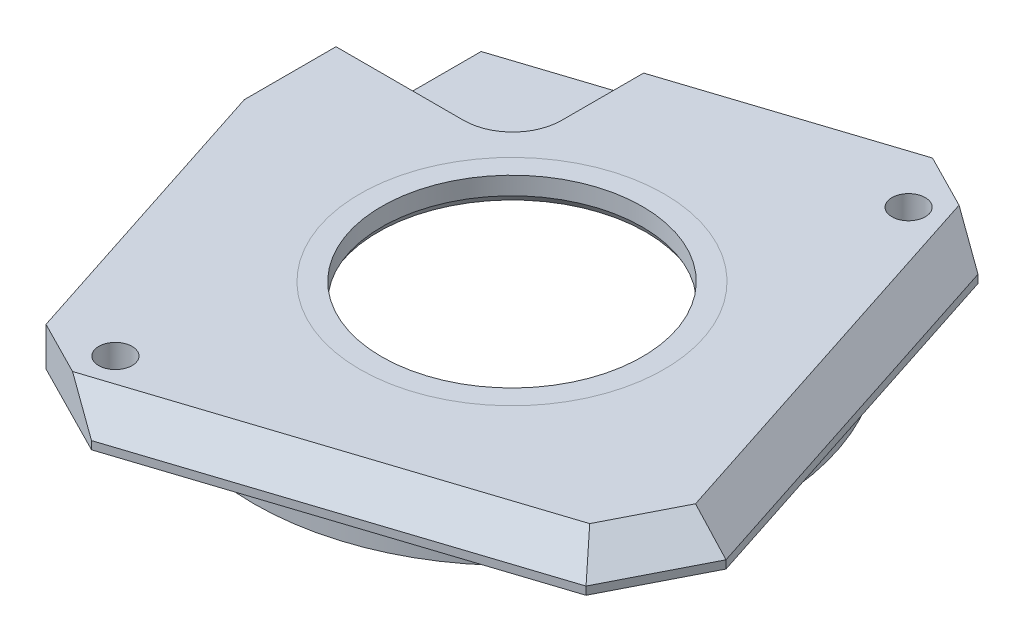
ISO-10303-21;
HEADER;
FILE_DESCRIPTION(('STEP AP214'),'2;1');
FILE_NAME('part.step','',(''),(''),'','','');
FILE_SCHEMA(('AUTOMOTIVE_DESIGN { 1 0 10303 214 1 1 1 1 }'));
ENDSEC;
DATA;
#1=APPLICATION_CONTEXT('core data for automotive mechanical design processes');
#2=APPLICATION_PROTOCOL_DEFINITION('international standard','automotive_design',2000,#1);
#3=PRODUCT_CONTEXT('',#1,'mechanical');
#4=PRODUCT('Part','Part','',(#3));
#5=PRODUCT_RELATED_PRODUCT_CATEGORY('part','',(#4));
#6=PRODUCT_DEFINITION_FORMATION('','',#4);
#7=PRODUCT_DEFINITION_CONTEXT('part definition',#1,'design');
#8=PRODUCT_DEFINITION('design','',#6,#7);
#9=PRODUCT_DEFINITION_SHAPE('','',#8);
#10=(LENGTH_UNIT() NAMED_UNIT(*) SI_UNIT(.MILLI.,.METRE.));
#11=(NAMED_UNIT(*) PLANE_ANGLE_UNIT() SI_UNIT($,.RADIAN.));
#12=(NAMED_UNIT(*) SI_UNIT($,.STERADIAN.) SOLID_ANGLE_UNIT());
#13=UNCERTAINTY_MEASURE_WITH_UNIT(LENGTH_MEASURE(1.E-05),#10,'distance_accuracy_value','');
#14=(GEOMETRIC_REPRESENTATION_CONTEXT(3) GLOBAL_UNCERTAINTY_ASSIGNED_CONTEXT((#13)) GLOBAL_UNIT_ASSIGNED_CONTEXT((#10,
#11,#12)) REPRESENTATION_CONTEXT('',''));
#15=CARTESIAN_POINT('',(0.,0.,0.));
#16=DIRECTION('',(0.,0.,1.));
#17=DIRECTION('',(1.,0.,0.));
#18=AXIS2_PLACEMENT_3D('',#15,#16,#17);
#19=CARTESIAN_POINT('',(0.,4.00558,0.));
#20=DIRECTION('',(0.,1.,0.));
#21=DIRECTION('',(0.,0.,1.));
#22=AXIS2_PLACEMENT_3D('',#19,#20,#21);
#23=PLANE('',#22);
#24=DIRECTION('',(1.,0.,0.));
#25=VECTOR('',#24,1.);
#26=CARTESIAN_POINT('',(-11.887,4.00558,-11.9534025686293));
#27=LINE('',#26,#25);
#28=CARTESIAN_POINT('',(-30.175,4.00558,-11.9534025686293));
#29=VERTEX_POINT('',#28);
#30=CARTESIAN_POINT('',(-16.967,4.00558,-11.9534025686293));
#31=VERTEX_POINT('',#30);
#32=EDGE_CURVE('E214',#29,#31,#27,.T.);
#33=ORIENTED_EDGE('',*,*,#32,.F.);
#34=DIRECTION('',(0.,0.,1.));
#35=VECTOR('',#34,1.);
#36=CARTESIAN_POINT('',(-30.175,4.00558,-2.45336121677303));
#37=LINE('',#36,#35);
#38=CARTESIAN_POINT('',(-30.175,4.00558,-2.45336121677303));
#39=VERTEX_POINT('',#38);
#40=EDGE_CURVE('E240',#29,#39,#37,.T.);
#41=ORIENTED_EDGE('',*,*,#40,.T.);
#42=DIRECTION('',(0.309017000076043,0.,0.951056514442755));
#43=VECTOR('',#42,1.);
#44=CARTESIAN_POINT('',(-30.175,4.00558,-2.45336121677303));
#45=LINE('',#44,#43);
#46=CARTESIAN_POINT('',(-20.2932935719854,4.00558,27.9594033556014));
#47=VERTEX_POINT('',#46);
#48=EDGE_CURVE('E243',#39,#47,#45,.T.);
#49=ORIENTED_EDGE('',*,*,#48,.T.);
#50=DIRECTION('',(-0.891006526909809,0.,-0.453990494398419));
#51=VECTOR('',#50,1.);
#52=CARTESIAN_POINT('',(-15.4924134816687,4.00558,30.4055739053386));
#53=LINE('',#52,#51);
#54=CARTESIAN_POINT('',(-14.6922667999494,4.00558,30.8132689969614));
#55=VERTEX_POINT('',#54);
#56=EDGE_CURVE('E298',#47,#55,#53,.F.);
#57=ORIENTED_EDGE('',*,*,#56,.T.);
#58=DIRECTION('',(0.951056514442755,0.,-0.309017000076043));
#59=VECTOR('',#58,1.);
#60=CARTESIAN_POINT('',(7.65280600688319,4.00558,23.5529145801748));
#61=LINE('',#60,#59);
#62=CARTESIAN_POINT('',(25.7275132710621,4.00558,17.6800860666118));
#63=VERTEX_POINT('',#62);
#64=EDGE_CURVE('E329',#55,#63,#61,.T.);
#65=ORIENTED_EDGE('',*,*,#64,.T.);
#66=DIRECTION('',(0.453990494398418,0.,-0.891006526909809));
#67=VECTOR('',#66,1.);
#68=CARTESIAN_POINT('',(27.5766281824,4.00558,14.0509936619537));
#69=LINE('',#68,#67);
#70=CARTESIAN_POINT('',(29.4257430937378,4.00558,10.4219012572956));
#71=VERTEX_POINT('',#70);
#72=EDGE_CURVE('E332',#63,#71,#69,.T.);
#73=ORIENTED_EDGE('',*,*,#72,.T.);
#74=DIRECTION('',(-0.309017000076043,0.,-0.951056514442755));
#75=VECTOR('',#74,1.);
#76=CARTESIAN_POINT('',(23.5529145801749,4.00558,-7.65280600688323));
#77=LINE('',#76,#75);
#78=CARTESIAN_POINT('',(16.2925601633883,4.00558,-29.9978788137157));
#79=VERTEX_POINT('',#78);
#80=EDGE_CURVE('E335',#71,#79,#77,.T.);
#81=ORIENTED_EDGE('',*,*,#80,.T.);
#82=DIRECTION('',(0.891006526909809,0.,0.453990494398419));
#83=VECTOR('',#82,1.);
#84=CARTESIAN_POINT('',(15.4924134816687,4.00558,-30.4055739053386));
#85=LINE('',#84,#83);
#86=CARTESIAN_POINT('',(10.6915333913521,4.00558,-32.8517444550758));
#87=VERTEX_POINT('',#86);
#88=EDGE_CURVE('E302',#79,#87,#85,.F.);
#89=ORIENTED_EDGE('',*,*,#88,.T.);
#90=DIRECTION('',(-0.951056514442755,0.,0.309017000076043));
#91=VECTOR('',#90,1.);
#92=CARTESIAN_POINT('',(-10.2361999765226,4.00558,-26.0519115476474));
#93=LINE('',#92,#91);
#94=CARTESIAN_POINT('',(-11.887,4.00558,-25.5155340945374));
#95=VERTEX_POINT('',#94);
#96=EDGE_CURVE('E247',#87,#95,#93,.T.);
#97=ORIENTED_EDGE('',*,*,#96,.T.);
#98=DIRECTION('',(0.,0.,-1.));
#99=VECTOR('',#98,1.);
#100=CARTESIAN_POINT('',(-11.887,4.00558,-11.9534025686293));
#101=LINE('',#100,#99);
#102=CARTESIAN_POINT('',(-11.887,4.00558,-17.0334025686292));
#103=VERTEX_POINT('',#102);
#104=EDGE_CURVE('E208',#103,#95,#101,.T.);
#105=ORIENTED_EDGE('',*,*,#104,.F.);
#106=CARTESIAN_POINT('',(-16.967,4.00558,-17.0334025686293));
#107=DIRECTION('',(0.,1.,0.));
#108=DIRECTION('',(0.,0.,1.));
#109=AXIS2_PLACEMENT_3D('',#106,#107,#108);
#110=CIRCLE('',#109,5.08);
#111=EDGE_CURVE('E74',#103,#31,#110,.F.);
#112=ORIENTED_EDGE('',*,*,#111,.T.);
#113=EDGE_LOOP('',(#33,#41,#49,#57,#65,#73,#81,#89,#97,#105,#112));
#114=FACE_BOUND('',#113,.T.);
#115=CARTESIAN_POINT('',(13.8616330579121,4.00558,-27.204932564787));
#116=DIRECTION('',(0.,1.,0.));
#117=DIRECTION('',(0.,0.,1.));
#118=AXIS2_PLACEMENT_3D('',#115,#116,#117);
#119=CIRCLE('',#118,1.7272);
#120=CARTESIAN_POINT('',(13.8616330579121,4.00558,-25.477732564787));
#121=VERTEX_POINT('',#120);
#122=EDGE_CURVE('E276',#121,#121,#119,.T.);
#123=ORIENTED_EDGE('',*,*,#122,.F.);
#124=EDGE_LOOP('',(#123));
#125=FACE_BOUND('',#124,.T.);
#126=CARTESIAN_POINT('',(-13.86163312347,4.00558,27.2050416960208));
#127=DIRECTION('',(0.,1.,0.));
#128=DIRECTION('',(0.,0.,1.));
#129=AXIS2_PLACEMENT_3D('',#126,#127,#128);
#130=CIRCLE('',#129,1.7272);
#131=CARTESIAN_POINT('',(-13.86163312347,4.00558,28.9322416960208));
#132=VERTEX_POINT('',#131);
#133=EDGE_CURVE('E268',#132,#132,#130,.T.);
#134=ORIENTED_EDGE('',*,*,#133,.F.);
#135=EDGE_LOOP('',(#134));
#136=FACE_BOUND('',#135,.T.);
#137=CARTESIAN_POINT('',(0.,4.00558,0.));
#138=DIRECTION('',(0.,1.,0.));
#139=DIRECTION('',(0.,0.,1.));
#140=AXIS2_PLACEMENT_3D('',#137,#138,#139);
#141=CIRCLE('',#140,15.748);
#142=CARTESIAN_POINT('',(0.,4.00558,15.748));
#143=VERTEX_POINT('',#142);
#144=EDGE_CURVE('E354',#143,#143,#141,.F.);
#145=ORIENTED_EDGE('',*,*,#144,.T.);
#146=EDGE_LOOP('',(#145));
#147=FACE_BOUND('',#146,.T.);
#148=ADVANCED_FACE('F46',(#114,#125,#136,#147),#23,.T.);
#149=CARTESIAN_POINT('',(0.,0.,0.));
#150=DIRECTION('',(0.,1.,0.));
#151=DIRECTION('',(0.,0.,1.));
#152=AXIS2_PLACEMENT_3D('',#149,#150,#151);
#153=PLANE('',#152);
#154=CARTESIAN_POINT('',(0.,0.,0.));
#155=DIRECTION('',(0.,1.,0.));
#156=DIRECTION('',(0.,0.,1.));
#157=AXIS2_PLACEMENT_3D('',#154,#155,#156);
#158=CIRCLE('',#157,26.745999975);
#159=CARTESIAN_POINT('',(0.,0.,26.745999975));
#160=VERTEX_POINT('',#159);
#161=EDGE_CURVE('E287',#160,#160,#158,.F.);
#162=ORIENTED_EDGE('',*,*,#161,.F.);
#163=EDGE_LOOP('',(#162));
#164=FACE_BOUND('',#163,.T.);
#165=CARTESIAN_POINT('',(13.8616330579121,0.,-27.204932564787));
#166=DIRECTION('',(0.,1.,0.));
#167=DIRECTION('',(0.,0.,1.));
#168=AXIS2_PLACEMENT_3D('',#165,#166,#167);
#169=CIRCLE('',#168,1.7272);
#170=CARTESIAN_POINT('',(13.8616330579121,0.,-25.477732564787));
#171=VERTEX_POINT('',#170);
#172=EDGE_CURVE('E272',#171,#171,#169,.T.);
#173=ORIENTED_EDGE('',*,*,#172,.T.);
#174=EDGE_LOOP('',(#173));
#175=FACE_BOUND('',#174,.T.);
#176=CARTESIAN_POINT('',(-13.86163312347,0.,27.2050416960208));
#177=DIRECTION('',(0.,1.,0.));
#178=DIRECTION('',(0.,0.,1.));
#179=AXIS2_PLACEMENT_3D('',#176,#177,#178);
#180=CIRCLE('',#179,1.7272);
#181=CARTESIAN_POINT('',(-13.86163312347,0.,28.9322416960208));
#182=VERTEX_POINT('',#181);
#183=EDGE_CURVE('E267',#182,#182,#180,.T.);
#184=ORIENTED_EDGE('',*,*,#183,.T.);
#185=EDGE_LOOP('',(#184));
#186=FACE_BOUND('',#185,.T.);
#187=DIRECTION('',(-1.,0.,0.));
#188=VECTOR('',#187,1.);
#189=CARTESIAN_POINT('',(-30.175,0.,-11.9534025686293));
#190=LINE('',#189,#188);
#191=CARTESIAN_POINT('',(-24.587,0.,-11.9534025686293));
#192=VERTEX_POINT('',#191);
#193=CARTESIAN_POINT('',(-30.175,0.,-11.9534025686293));
#194=VERTEX_POINT('',#193);
#195=EDGE_CURVE('E525',#192,#194,#190,.T.);
#196=ORIENTED_EDGE('',*,*,#195,.F.);
#197=DIRECTION('',(0.,0.,1.));
#198=VECTOR('',#197,1.);
#199=CARTESIAN_POINT('',(-24.587,0.,-11.9534025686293));
#200=LINE('',#199,#198);
#201=CARTESIAN_POINT('',(-24.587,0.,-21.3890538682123));
#202=VERTEX_POINT('',#201);
#203=EDGE_CURVE('E190',#202,#192,#200,.T.);
#204=ORIENTED_EDGE('',*,*,#203,.F.);
#205=DIRECTION('',(0.951056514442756,0.,-0.309017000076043));
#206=VECTOR('',#205,1.);
#207=CARTESIAN_POINT('',(-10.2361999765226,0.,-26.0519115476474));
#208=LINE('',#207,#206);
#209=CARTESIAN_POINT('',(10.6915333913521,0.,-32.8517444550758));
#210=VERTEX_POINT('',#209);
#211=EDGE_CURVE('E237',#202,#210,#208,.T.);
#212=ORIENTED_EDGE('',*,*,#211,.T.);
#213=DIRECTION('',(-0.891006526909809,0.,-0.453990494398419));
#214=VECTOR('',#213,1.);
#215=CARTESIAN_POINT('',(20.2932935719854,0.,-27.9594033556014));
#216=LINE('',#215,#214);
#217=CARTESIAN_POINT('',(20.2932935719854,0.,-27.9594033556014));
#218=VERTEX_POINT('',#217);
#219=EDGE_CURVE('E315',#210,#218,#216,.F.);
#220=ORIENTED_EDGE('',*,*,#219,.T.);
#221=DIRECTION('',(0.309017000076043,0.,0.951056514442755));
#222=VECTOR('',#221,1.);
#223=CARTESIAN_POINT('',(17.938584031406,0.,-35.2064539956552));
#224=LINE('',#223,#222);
#225=CARTESIAN_POINT('',(32.8517444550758,0.,10.691533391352));
#226=VERTEX_POINT('',#225);
#227=EDGE_CURVE('E233',#218,#226,#224,.T.);
#228=ORIENTED_EDGE('',*,*,#227,.T.);
#229=DIRECTION('',(0.453990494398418,0.,-0.891006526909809));
#230=VECTOR('',#229,1.);
#231=CARTESIAN_POINT('',(27.9594033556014,0.,20.2932935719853));
#232=LINE('',#231,#230);
#233=CARTESIAN_POINT('',(27.9594033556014,0.,20.2932935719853));
#234=VERTEX_POINT('',#233);
#235=EDGE_CURVE('E312',#226,#234,#232,.F.);
#236=ORIENTED_EDGE('',*,*,#235,.T.);
#237=DIRECTION('',(-0.951056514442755,0.,0.309017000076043));
#238=VECTOR('',#237,1.);
#239=CARTESIAN_POINT('',(35.2064539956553,0.,17.9385840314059));
#240=LINE('',#239,#238);
#241=CARTESIAN_POINT('',(-10.6915333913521,0.,32.8517444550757));
#242=VERTEX_POINT('',#241);
#243=EDGE_CURVE('E228',#234,#242,#240,.T.);
#244=ORIENTED_EDGE('',*,*,#243,.T.);
#245=DIRECTION('',(0.891006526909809,0.,0.453990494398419));
#246=VECTOR('',#245,1.);
#247=CARTESIAN_POINT('',(-20.2932935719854,0.,27.9594033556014));
#248=LINE('',#247,#246);
#249=CARTESIAN_POINT('',(-20.2932935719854,0.,27.9594033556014));
#250=VERTEX_POINT('',#249);
#251=EDGE_CURVE('E309',#242,#250,#248,.F.);
#252=ORIENTED_EDGE('',*,*,#251,.T.);
#253=DIRECTION('',(-0.309017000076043,0.,-0.951056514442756));
#254=VECTOR('',#253,1.);
#255=CARTESIAN_POINT('',(-30.175,0.,-2.45336121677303));
#256=LINE('',#255,#254);
#257=CARTESIAN_POINT('',(-30.175,0.,-2.45336121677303));
#258=VERTEX_POINT('',#257);
#259=EDGE_CURVE('E225',#250,#258,#256,.T.);
#260=ORIENTED_EDGE('',*,*,#259,.T.);
#261=DIRECTION('',(0.,0.,-1.));
#262=VECTOR('',#261,1.);
#263=CARTESIAN_POINT('',(-30.175,0.,-2.45336121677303));
#264=LINE('',#263,#262);
#265=EDGE_CURVE('E255',#258,#194,#264,.T.);
#266=ORIENTED_EDGE('',*,*,#265,.T.);
#267=EDGE_LOOP('',(#196,#204,#212,#220,#228,#236,#244,#252,#260,#266));
#268=FACE_BOUND('',#267,.T.);
#269=ADVANCED_FACE('F405',(#164,#175,#186,#268),#153,.F.);
#270=ORIENTED_EDGE('',*,*,#144,.F.);
#271=EDGE_LOOP('',(#270));
#272=FACE_BOUND('',#271,.T.);
#273=CARTESIAN_POINT('',(0.,4.00558,0.));
#274=DIRECTION('',(0.,1.,0.));
#275=DIRECTION('',(0.,0.,1.));
#276=AXIS2_PLACEMENT_3D('',#273,#274,#275);
#277=CIRCLE('',#276,13.49375);
#278=CARTESIAN_POINT('',(0.,4.00558,13.49375));
#279=VERTEX_POINT('',#278);
#280=EDGE_CURVE('E280',#279,#279,#277,.T.);
#281=ORIENTED_EDGE('',*,*,#280,.F.);
#282=EDGE_LOOP('',(#281));
#283=FACE_BOUND('',#282,.T.);
#284=ADVANCED_FACE('F407',(#272,#283),#23,.T.);
#285=CARTESIAN_POINT('',(0.,4.00558,0.));
#286=DIRECTION('',(0.,-1.,0.));
#287=DIRECTION('',(0.,0.,-1.));
#288=AXIS2_PLACEMENT_3D('',#285,#286,#287);
#289=CYLINDRICAL_SURFACE('',#288,13.49375);
#290=CARTESIAN_POINT('',(0.,2.15899999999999,0.));
#291=DIRECTION('',(0.,-1.,0.));
#292=DIRECTION('',(0.,0.,-1.));
#293=AXIS2_PLACEMENT_3D('',#290,#291,#292);
#294=CIRCLE('',#293,13.49375);
#295=CARTESIAN_POINT('',(0.,2.15899999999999,-13.49375));
#296=VERTEX_POINT('',#295);
#297=EDGE_CURVE('E55',#296,#296,#294,.T.);
#298=ORIENTED_EDGE('',*,*,#297,.T.);
#299=EDGE_LOOP('',(#298));
#300=FACE_BOUND('',#299,.T.);
#301=ORIENTED_EDGE('',*,*,#280,.T.);
#302=EDGE_LOOP('',(#301));
#303=FACE_BOUND('',#302,.T.);
#304=ADVANCED_FACE('F393',(#300,#303),#289,.F.);
#305=CARTESIAN_POINT('',(13.8616330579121,4.00558,-27.204932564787));
#306=DIRECTION('',(0.,-1.,0.));
#307=DIRECTION('',(0.,0.,-1.));
#308=AXIS2_PLACEMENT_3D('',#305,#306,#307);
#309=CYLINDRICAL_SURFACE('',#308,1.7272);
#310=ORIENTED_EDGE('',*,*,#122,.T.);
#311=EDGE_LOOP('',(#310));
#312=FACE_BOUND('',#311,.T.);
#313=ORIENTED_EDGE('',*,*,#172,.F.);
#314=EDGE_LOOP('',(#313));
#315=FACE_BOUND('',#314,.T.);
#316=ADVANCED_FACE('F420',(#312,#315),#309,.F.);
#317=CARTESIAN_POINT('',(-13.86163312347,4.00558,27.2050416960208));
#318=DIRECTION('',(0.,-1.,0.));
#319=DIRECTION('',(0.,0.,-1.));
#320=AXIS2_PLACEMENT_3D('',#317,#318,#319);
#321=CYLINDRICAL_SURFACE('',#320,1.7272);
#322=ORIENTED_EDGE('',*,*,#133,.T.);
#323=EDGE_LOOP('',(#322));
#324=FACE_BOUND('',#323,.T.);
#325=ORIENTED_EDGE('',*,*,#183,.F.);
#326=EDGE_LOOP('',(#325));
#327=FACE_BOUND('',#326,.T.);
#328=ADVANCED_FACE('F428',(#324,#327),#321,.F.);
#329=CARTESIAN_POINT('',(0.,1.524,0.));
#330=DIRECTION('',(0.,-1.,0.));
#331=DIRECTION('',(0.,0.,-1.));
#332=AXIS2_PLACEMENT_3D('',#329,#330,#331);
#333=CYLINDRICAL_SURFACE('',#332,21.59);
#334=CARTESIAN_POINT('',(0.,-1.016,0.));
#335=DIRECTION('',(0.,-1.,0.));
#336=DIRECTION('',(0.,0.,-1.));
#337=AXIS2_PLACEMENT_3D('',#334,#335,#336);
#338=CIRCLE('',#337,21.59);
#339=CARTESIAN_POINT('',(0.,-1.016,-21.59));
#340=VERTEX_POINT('',#339);
#341=EDGE_CURVE('E368',#340,#340,#338,.F.);
#342=CARTESIAN_POINT('',(0.,-2.54,0.));
#343=DIRECTION('',(0.,-1.,0.));
#344=DIRECTION('',(0.,0.,-1.));
#345=AXIS2_PLACEMENT_3D('',#342,#343,#344);
#346=CIRCLE('',#345,21.59);
#347=CARTESIAN_POINT('',(0.,-2.54,-21.59));
#348=VERTEX_POINT('',#347);
#349=EDGE_CURVE('E259',#348,#348,#346,.T.);
#350=CARTESIAN_POINT('',(0.,-1.016,-21.59));
#351=CARTESIAN_POINT('',(0.,-1.031875,-21.59));
#352=CARTESIAN_POINT('',(0.,-1.04775,-21.59));
#353=CARTESIAN_POINT('',(0.,-1.0795,-21.59));
#354=CARTESIAN_POINT('',(0.,-1.095375,-21.59));
#355=CARTESIAN_POINT('',(0.,-1.127125,-21.59));
#356=CARTESIAN_POINT('',(0.,-1.143,-21.59));
#357=CARTESIAN_POINT('',(0.,-1.17475,-21.59));
#358=CARTESIAN_POINT('',(0.,-1.190625,-21.59));
#359=CARTESIAN_POINT('',(0.,-1.222375,-21.59));
#360=CARTESIAN_POINT('',(0.,-1.23825,-21.59));
#361=CARTESIAN_POINT('',(0.,-1.27,-21.59));
#362=CARTESIAN_POINT('',(0.,-1.285875,-21.59));
#363=CARTESIAN_POINT('',(0.,-1.317625,-21.59));
#364=CARTESIAN_POINT('',(0.,-1.3335,-21.59));
#365=CARTESIAN_POINT('',(0.,-1.36525,-21.59));
#366=CARTESIAN_POINT('',(0.,-1.381125,-21.59));
#367=CARTESIAN_POINT('',(0.,-1.412875,-21.59));
#368=CARTESIAN_POINT('',(0.,-1.42875,-21.59));
#369=CARTESIAN_POINT('',(0.,-1.4605,-21.59));
#370=CARTESIAN_POINT('',(0.,-1.476375,-21.59));
#371=CARTESIAN_POINT('',(0.,-1.508125,-21.59));
#372=CARTESIAN_POINT('',(0.,-1.524,-21.59));
#373=CARTESIAN_POINT('',(0.,-1.55575,-21.59));
#374=CARTESIAN_POINT('',(0.,-1.571625,-21.59));
#375=CARTESIAN_POINT('',(0.,-1.603375,-21.59));
#376=CARTESIAN_POINT('',(0.,-1.61925,-21.59));
#377=CARTESIAN_POINT('',(0.,-1.651,-21.59));
#378=CARTESIAN_POINT('',(0.,-1.666875,-21.59));
#379=CARTESIAN_POINT('',(0.,-1.698625,-21.59));
#380=CARTESIAN_POINT('',(0.,-1.7145,-21.59));
#381=CARTESIAN_POINT('',(0.,-1.74625,-21.59));
#382=CARTESIAN_POINT('',(0.,-1.762125,-21.59));
#383=CARTESIAN_POINT('',(0.,-1.793875,-21.59));
#384=CARTESIAN_POINT('',(0.,-1.80975,-21.59));
#385=CARTESIAN_POINT('',(0.,-1.8415,-21.59));
#386=CARTESIAN_POINT('',(0.,-1.857375,-21.59));
#387=CARTESIAN_POINT('',(0.,-1.889125,-21.59));
#388=CARTESIAN_POINT('',(0.,-1.905,-21.59));
#389=CARTESIAN_POINT('',(0.,-1.93675,-21.59));
#390=CARTESIAN_POINT('',(0.,-1.952625,-21.59));
#391=CARTESIAN_POINT('',(0.,-1.984375,-21.59));
#392=CARTESIAN_POINT('',(0.,-2.00025,-21.59));
#393=CARTESIAN_POINT('',(0.,-2.032,-21.59));
#394=CARTESIAN_POINT('',(0.,-2.047875,-21.59));
#395=CARTESIAN_POINT('',(0.,-2.079625,-21.59));
#396=CARTESIAN_POINT('',(0.,-2.0955,-21.59));
#397=CARTESIAN_POINT('',(0.,-2.12725,-21.59));
#398=CARTESIAN_POINT('',(0.,-2.143125,-21.59));
#399=CARTESIAN_POINT('',(0.,-2.174875,-21.59));
#400=CARTESIAN_POINT('',(0.,-2.19075,-21.59));
#401=CARTESIAN_POINT('',(0.,-2.2225,-21.59));
#402=CARTESIAN_POINT('',(0.,-2.238375,-21.59));
#403=CARTESIAN_POINT('',(0.,-2.270125,-21.59));
#404=CARTESIAN_POINT('',(0.,-2.286,-21.59));
#405=CARTESIAN_POINT('',(0.,-2.31775,-21.59));
#406=CARTESIAN_POINT('',(0.,-2.333625,-21.59));
#407=CARTESIAN_POINT('',(0.,-2.365375,-21.59));
#408=CARTESIAN_POINT('',(0.,-2.38125,-21.59));
#409=CARTESIAN_POINT('',(0.,-2.413,-21.59));
#410=CARTESIAN_POINT('',(0.,-2.428875,-21.59));
#411=CARTESIAN_POINT('',(0.,-2.460625,-21.59));
#412=CARTESIAN_POINT('',(0.,-2.4765,-21.59));
#413=CARTESIAN_POINT('',(0.,-2.50825,-21.59));
#414=CARTESIAN_POINT('',(0.,-2.524125,-21.59));
#415=CARTESIAN_POINT('',(0.,-2.54,-21.59));
#416=B_SPLINE_CURVE_WITH_KNOTS('',3,(#350,#351,#352,#353,#354,#355,#356,#357,#358,#359,#360,
#361,#362,#363,#364,#365,#366,#367,#368,#369,#370,#371,#372,#373,#374,#375,#376,#377,#378,#379,
#380,#381,#382,#383,#384,#385,#386,#387,#388,#389,#390,#391,#392,#393,#394,#395,#396,#397,#398,
#399,#400,#401,#402,#403,#404,#405,#406,#407,#408,#409,#410,#411,#412,#413,#414,#415),
.UNSPECIFIED.,.F.,.F.,(4,2,2,2,2,2,2,2,2,2,2,2,2,2,2,2,2,2,2,2,2,2,2,2,2,2,2,2,2,2,2,2,4),(0.,
0.0476249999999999,0.0952499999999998,0.142875,0.1905,0.238125,0.28575,0.333375,0.381,0.428625,
0.47625,0.523875,0.5715,0.619125,0.666750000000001,0.714375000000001,0.762000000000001,0.809625,
0.85725,0.904875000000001,0.9525,1.000125,1.04775,1.095375,1.143,1.190625,1.23825,1.285875,
1.3335,1.381125,1.42875,1.476375,1.524),.UNSPECIFIED.);
#417=EDGE_CURVE('BSEAM434',#340,#348,#416,.T.);
#418=ORIENTED_EDGE('',*,*,#341,.T.);
#419=ORIENTED_EDGE('',*,*,#349,.T.);
#420=ORIENTED_EDGE('',*,*,#417,.T.);
#421=ORIENTED_EDGE('',*,*,#417,.F.);
#422=EDGE_LOOP('',(#418,#420,#419,#421));
#423=FACE_BOUND('',#422,.T.);
#424=ADVANCED_FACE('F434',(#423),#333,.F.);
#425=CARTESIAN_POINT('',(0.,1.524,0.));
#426=DIRECTION('',(0.,-1.,0.));
#427=DIRECTION('',(0.,0.,-1.));
#428=AXIS2_PLACEMENT_3D('',#425,#426,#427);
#429=PLANE('',#428);
#430=CARTESIAN_POINT('',(0.,1.524,0.));
#431=DIRECTION('',(0.,-1.,0.));
#432=DIRECTION('',(0.,0.,-1.));
#433=AXIS2_PLACEMENT_3D('',#430,#431,#432);
#434=CIRCLE('',#433,13.8603674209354);
#435=CARTESIAN_POINT('',(0.,1.524,-13.8603674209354));
#436=VERTEX_POINT('',#435);
#437=EDGE_CURVE('E11',#436,#436,#434,.F.);
#438=ORIENTED_EDGE('',*,*,#437,.T.);
#439=EDGE_LOOP('',(#438));
#440=FACE_BOUND('',#439,.T.);
#441=CARTESIAN_POINT('',(0.,1.524,0.));
#442=DIRECTION('',(0.,-1.,0.));
#443=DIRECTION('',(0.,0.,-1.));
#444=AXIS2_PLACEMENT_3D('',#441,#442,#443);
#445=CIRCLE('',#444,19.05);
#446=CARTESIAN_POINT('',(0.,1.524,-19.05));
#447=VERTEX_POINT('',#446);
#448=EDGE_CURVE('E364',#447,#447,#445,.T.);
#449=ORIENTED_EDGE('',*,*,#448,.T.);
#450=EDGE_LOOP('',(#449));
#451=FACE_BOUND('',#450,.T.);
#452=ADVANCED_FACE('F438',(#440,#451),#429,.T.);
#453=CARTESIAN_POINT('',(0.,-2.54,0.));
#454=DIRECTION('',(0.,-1.,0.));
#455=DIRECTION('',(0.,0.,-1.));
#456=AXIS2_PLACEMENT_3D('',#453,#454,#455);
#457=PLANE('',#456);
#458=CARTESIAN_POINT('',(0.,-2.54,0.));
#459=DIRECTION('',(0.,-1.,0.));
#460=DIRECTION('',(0.,0.,-1.));
#461=AXIS2_PLACEMENT_3D('',#458,#459,#460);
#462=CIRCLE('',#461,26.745999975);
#463=CARTESIAN_POINT('',(0.,-2.54,-26.745999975));
#464=VERTEX_POINT('',#463);
#465=EDGE_CURVE('E263',#464,#464,#462,.T.);
#466=ORIENTED_EDGE('',*,*,#465,.T.);
#467=EDGE_LOOP('',(#466));
#468=FACE_BOUND('',#467,.T.);
#469=ORIENTED_EDGE('',*,*,#349,.F.);
#470=EDGE_LOOP('',(#469));
#471=FACE_BOUND('',#470,.T.);
#472=ADVANCED_FACE('F442',(#468,#471),#457,.T.);
#473=CARTESIAN_POINT('',(0.,-2.54,0.));
#474=DIRECTION('',(0.,1.,0.));
#475=DIRECTION('',(0.,0.,1.));
#476=AXIS2_PLACEMENT_3D('',#473,#474,#475);
#477=CYLINDRICAL_SURFACE('',#476,26.745999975);
#478=ORIENTED_EDGE('',*,*,#465,.F.);
#479=EDGE_LOOP('',(#478));
#480=FACE_BOUND('',#479,.T.);
#481=ORIENTED_EDGE('',*,*,#161,.T.);
#482=EDGE_LOOP('',(#481));
#483=FACE_BOUND('',#482,.T.);
#484=ADVANCED_FACE('F444',(#480,#483),#477,.T.);
#485=CARTESIAN_POINT('',(-10.2361999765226,-2.541,-26.0519115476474));
#486=DIRECTION('',(-0.309017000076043,0.,-0.951056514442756));
#487=DIRECTION('',(-0.951056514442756,0.,0.309017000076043));
#488=AXIS2_PLACEMENT_3D('',#485,#486,#487);
#489=PLANE('',#488);
#490=DIRECTION('',(0.,-1.,0.));
#491=VECTOR('',#490,1.);
#492=CARTESIAN_POINT('',(-24.587,-2.541,-21.3890538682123));
#493=LINE('',#492,#491);
#494=CARTESIAN_POINT('',(-24.587,1.651,-21.3890538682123));
#495=VERTEX_POINT('',#494);
#496=EDGE_CURVE('E217',#495,#202,#493,.T.);
#497=ORIENTED_EDGE('',*,*,#496,.F.);
#498=DIRECTION('',(-0.951056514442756,0.,0.309017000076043));
#499=VECTOR('',#498,1.);
#500=CARTESIAN_POINT('',(-10.2361999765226,1.651,-26.0519115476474));
#501=LINE('',#500,#499);
#502=CARTESIAN_POINT('',(-11.887,1.651,-25.5155340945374));
#503=VERTEX_POINT('',#502);
#504=EDGE_CURVE('E199',#503,#495,#501,.T.);
#505=ORIENTED_EDGE('',*,*,#504,.F.);
#506=DIRECTION('',(0.,-1.,0.));
#507=VECTOR('',#506,1.);
#508=CARTESIAN_POINT('',(-11.887,-2.541,-25.5155340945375));
#509=LINE('',#508,#507);
#510=EDGE_CURVE('E375',#95,#503,#509,.T.);
#511=ORIENTED_EDGE('',*,*,#510,.F.);
#512=ORIENTED_EDGE('',*,*,#96,.F.);
#513=DIRECTION('',(0.,-1.,0.));
#514=VECTOR('',#513,1.);
#515=CARTESIAN_POINT('',(10.6915333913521,-2.541,-32.8517444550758));
#516=LINE('',#515,#514);
#517=EDGE_CURVE('E305',#87,#210,#516,.T.);
#518=ORIENTED_EDGE('',*,*,#517,.T.);
#519=ORIENTED_EDGE('',*,*,#211,.F.);
#520=EDGE_LOOP('',(#497,#505,#511,#512,#518,#519));
#521=FACE_BOUND('',#520,.T.);
#522=ADVANCED_FACE('F447',(#521),#489,.T.);
#523=CARTESIAN_POINT('',(17.938584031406,-2.541,-35.2064539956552));
#524=DIRECTION('',(0.951056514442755,0.,-0.309017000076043));
#525=DIRECTION('',(-0.309017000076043,0.,-0.951056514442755));
#526=AXIS2_PLACEMENT_3D('',#523,#524,#525);
#527=PLANE('',#526);
#528=DIRECTION('',(0.,1.,0.));
#529=VECTOR('',#528,1.);
#530=CARTESIAN_POINT('',(20.2932935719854,-2.541,-27.9594033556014));
#531=LINE('',#530,#529);
#532=CARTESIAN_POINT('',(20.2932935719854,0.830579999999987,-27.9594033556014));
#533=VERTEX_POINT('',#532);
#534=EDGE_CURVE('E294',#218,#533,#531,.T.);
#535=ORIENTED_EDGE('',*,*,#534,.T.);
#536=DIRECTION('',(0.309017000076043,0.,0.951056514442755));
#537=VECTOR('',#536,1.);
#538=CARTESIAN_POINT('',(17.938584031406,0.830579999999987,-35.2064539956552));
#539=LINE('',#538,#537);
#540=CARTESIAN_POINT('',(32.8517444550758,0.830579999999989,10.691533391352));
#541=VERTEX_POINT('',#540);
#542=EDGE_CURVE('E342',#533,#541,#539,.T.);
#543=ORIENTED_EDGE('',*,*,#542,.T.);
#544=DIRECTION('',(0.,-1.,0.));
#545=VECTOR('',#544,1.);
#546=CARTESIAN_POINT('',(32.8517444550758,-2.541,10.691533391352));
#547=LINE('',#546,#545);
#548=EDGE_CURVE('E291',#541,#226,#547,.T.);
#549=ORIENTED_EDGE('',*,*,#548,.T.);
#550=ORIENTED_EDGE('',*,*,#227,.F.);
#551=EDGE_LOOP('',(#535,#543,#549,#550));
#552=FACE_BOUND('',#551,.T.);
#553=ADVANCED_FACE('F464',(#552),#527,.T.);
#554=CARTESIAN_POINT('',(35.2064539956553,-2.541,17.9385840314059));
#555=DIRECTION('',(0.309017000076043,0.,0.951056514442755));
#556=DIRECTION('',(0.951056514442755,0.,-0.309017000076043));
#557=AXIS2_PLACEMENT_3D('',#554,#555,#556);
#558=PLANE('',#557);
#559=DIRECTION('',(0.,1.,0.));
#560=VECTOR('',#559,1.);
#561=CARTESIAN_POINT('',(27.9594033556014,-2.541,20.2932935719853));
#562=LINE('',#561,#560);
#563=CARTESIAN_POINT('',(27.9594033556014,0.83057999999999,20.2932935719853));
#564=VERTEX_POINT('',#563);
#565=EDGE_CURVE('E321',#234,#564,#562,.T.);
#566=ORIENTED_EDGE('',*,*,#565,.T.);
#567=DIRECTION('',(-0.951056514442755,0.,0.309017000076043));
#568=VECTOR('',#567,1.);
#569=CARTESIAN_POINT('',(35.2064539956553,0.83057999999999,17.9385840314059));
#570=LINE('',#569,#568);
#571=CARTESIAN_POINT('',(-10.6915333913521,0.830579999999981,32.8517444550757));
#572=VERTEX_POINT('',#571);
#573=EDGE_CURVE('E348',#564,#572,#570,.T.);
#574=ORIENTED_EDGE('',*,*,#573,.T.);
#575=DIRECTION('',(0.,-1.,0.));
#576=VECTOR('',#575,1.);
#577=CARTESIAN_POINT('',(-10.6915333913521,-2.541,32.8517444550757));
#578=LINE('',#577,#576);
#579=EDGE_CURVE('E318',#572,#242,#578,.T.);
#580=ORIENTED_EDGE('',*,*,#579,.T.);
#581=ORIENTED_EDGE('',*,*,#243,.F.);
#582=EDGE_LOOP('',(#566,#574,#580,#581));
#583=FACE_BOUND('',#582,.T.);
#584=ADVANCED_FACE('F460',(#583),#558,.T.);
#585=CARTESIAN_POINT('',(-30.175,-2.541,-2.45336121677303));
#586=DIRECTION('',(-0.951056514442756,0.,0.309017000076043));
#587=DIRECTION('',(0.309017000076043,0.,0.951056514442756));
#588=AXIS2_PLACEMENT_3D('',#585,#586,#587);
#589=PLANE('',#588);
#590=ORIENTED_EDGE('',*,*,#259,.F.);
#591=DIRECTION('',(0.,1.,0.));
#592=VECTOR('',#591,1.);
#593=CARTESIAN_POINT('',(-20.2932935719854,-2.541,27.9594033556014));
#594=LINE('',#593,#592);
#595=EDGE_CURVE('E325',#250,#47,#594,.T.);
#596=ORIENTED_EDGE('',*,*,#595,.T.);
#597=ORIENTED_EDGE('',*,*,#48,.F.);
#598=DIRECTION('',(0.,1.,0.));
#599=VECTOR('',#598,1.);
#600=CARTESIAN_POINT('',(-30.175,-2.541,-2.45336121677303));
#601=LINE('',#600,#599);
#602=EDGE_CURVE('E251',#258,#39,#601,.T.);
#603=ORIENTED_EDGE('',*,*,#602,.F.);
#604=EDGE_LOOP('',(#590,#596,#597,#603));
#605=FACE_BOUND('',#604,.T.);
#606=ADVANCED_FACE('F456',(#605),#589,.T.);
#607=CARTESIAN_POINT('',(-30.175,-2.541,-2.45336121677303));
#608=DIRECTION('',(-1.,0.,0.));
#609=DIRECTION('',(0.,0.,1.));
#610=AXIS2_PLACEMENT_3D('',#607,#608,#609);
#611=PLANE('',#610);
#612=DIRECTION('',(0.,1.,0.));
#613=VECTOR('',#612,1.);
#614=CARTESIAN_POINT('',(-30.175,-2.541,-11.9534025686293));
#615=LINE('',#614,#613);
#616=EDGE_CURVE('E372',#194,#29,#615,.T.);
#617=ORIENTED_EDGE('',*,*,#616,.F.);
#618=ORIENTED_EDGE('',*,*,#265,.F.);
#619=ORIENTED_EDGE('',*,*,#602,.T.);
#620=ORIENTED_EDGE('',*,*,#40,.F.);
#621=EDGE_LOOP('',(#617,#618,#619,#620));
#622=FACE_BOUND('',#621,.T.);
#623=ADVANCED_FACE('F452',(#622),#611,.T.);
#624=CARTESIAN_POINT('',(20.2932935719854,-2.541,-27.9594033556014));
#625=DIRECTION('',(-0.453990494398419,0.,0.891006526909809));
#626=DIRECTION('',(0.,1.,0.));
#627=AXIS2_PLACEMENT_3D('',#624,#625,#626);
#628=PLANE('',#627);
#629=ORIENTED_EDGE('',*,*,#88,.F.);
#630=DIRECTION('',(0.727503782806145,-0.577350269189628,0.370681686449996));
#631=VECTOR('',#630,1.);
#632=CARTESIAN_POINT('',(21.7094397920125,-0.293280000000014,-27.2378408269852));
#633=LINE('',#632,#631);
#634=EDGE_CURVE('E339',#79,#533,#633,.T.);
#635=ORIENTED_EDGE('',*,*,#634,.T.);
#636=ORIENTED_EDGE('',*,*,#534,.F.);
#637=ORIENTED_EDGE('',*,*,#219,.F.);
#638=ORIENTED_EDGE('',*,*,#517,.F.);
#639=EDGE_LOOP('',(#629,#635,#636,#637,#638));
#640=FACE_BOUND('',#639,.T.);
#641=ADVANCED_FACE('F455',(#640),#628,.F.);
#642=CARTESIAN_POINT('',(27.9594033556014,-2.541,20.2932935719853));
#643=DIRECTION('',(-0.891006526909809,0.,-0.453990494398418));
#644=DIRECTION('',(0.,1.,0.));
#645=AXIS2_PLACEMENT_3D('',#642,#643,#644);
#646=PLANE('',#645);
#647=ORIENTED_EDGE('',*,*,#548,.F.);
#648=DIRECTION('',(0.453990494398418,0.,-0.891006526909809));
#649=VECTOR('',#648,1.);
#650=CARTESIAN_POINT('',(27.9594033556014,0.830579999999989,20.2932935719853));
#651=LINE('',#650,#649);
#652=EDGE_CURVE('E345',#541,#564,#651,.F.);
#653=ORIENTED_EDGE('',*,*,#652,.T.);
#654=ORIENTED_EDGE('',*,*,#565,.F.);
#655=ORIENTED_EDGE('',*,*,#235,.F.);
#656=EDGE_LOOP('',(#647,#653,#654,#655));
#657=FACE_BOUND('',#656,.T.);
#658=ADVANCED_FACE('F505',(#657),#646,.F.);
#659=CARTESIAN_POINT('',(-20.2932935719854,-2.541,27.9594033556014));
#660=DIRECTION('',(0.453990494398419,0.,-0.891006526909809));
#661=DIRECTION('',(0.,1.,0.));
#662=AXIS2_PLACEMENT_3D('',#659,#660,#661);
#663=PLANE('',#662);
#664=ORIENTED_EDGE('',*,*,#579,.F.);
#665=DIRECTION('',(-0.727503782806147,0.577350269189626,-0.370681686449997));
#666=VECTOR('',#665,1.);
#667=CARTESIAN_POINT('',(-15.6765606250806,4.78672000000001,30.311746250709));
#668=LINE('',#667,#666);
#669=EDGE_CURVE('E351',#572,#55,#668,.T.);
#670=ORIENTED_EDGE('',*,*,#669,.T.);
#671=ORIENTED_EDGE('',*,*,#56,.F.);
#672=ORIENTED_EDGE('',*,*,#595,.F.);
#673=ORIENTED_EDGE('',*,*,#251,.F.);
#674=EDGE_LOOP('',(#664,#670,#671,#672,#673));
#675=FACE_BOUND('',#674,.T.);
#676=ADVANCED_FACE('F495',(#675),#663,.F.);
#677=CARTESIAN_POINT('',(7.6528060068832,4.00558,23.5529145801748));
#678=DIRECTION('',(-0.218508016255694,-0.707106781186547,-0.672498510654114));
#679=DIRECTION('',(0.951056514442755,0.,-0.309017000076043));
#680=AXIS2_PLACEMENT_3D('',#677,#678,#679);
#681=PLANE('',#680);
#682=ORIENTED_EDGE('',*,*,#669,.F.);
#683=ORIENTED_EDGE('',*,*,#573,.F.);
#684=DIRECTION('',(0.477025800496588,-0.678598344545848,0.558525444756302));
#685=VECTOR('',#684,1.);
#686=CARTESIAN_POINT('',(23.1792521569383,7.63063711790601,14.696455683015));
#687=LINE('',#686,#685);
#688=EDGE_CURVE('E229',#63,#564,#687,.T.);
#689=ORIENTED_EDGE('',*,*,#688,.F.);
#690=ORIENTED_EDGE('',*,*,#64,.F.);
#691=EDGE_LOOP('',(#682,#683,#689,#690));
#692=FACE_BOUND('',#691,.T.);
#693=ADVANCED_FACE('F491',(#692),#681,.F.);
#694=CARTESIAN_POINT('',(27.5766281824,4.00558,14.0509936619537));
#695=DIRECTION('',(0.630036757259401,0.707106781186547,0.321019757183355));
#696=DIRECTION('',(-0.453990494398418,0.,0.891006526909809));
#697=AXIS2_PLACEMENT_3D('',#694,#695,#696);
#698=PLANE('',#697);
#699=ORIENTED_EDGE('',*,*,#688,.T.);
#700=ORIENTED_EDGE('',*,*,#652,.F.);
#701=DIRECTION('',(0.732245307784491,-0.678598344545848,0.057628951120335));
#702=VECTOR('',#701,1.);
#703=CARTESIAN_POINT('',(28.5874211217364,4.78248344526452,10.3559238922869));
#704=LINE('',#703,#702);
#705=EDGE_CURVE('E224',#71,#541,#704,.T.);
#706=ORIENTED_EDGE('',*,*,#705,.F.);
#707=ORIENTED_EDGE('',*,*,#72,.F.);
#708=EDGE_LOOP('',(#699,#700,#706,#707));
#709=FACE_BOUND('',#708,.T.);
#710=ADVANCED_FACE('F494',(#709),#698,.T.);
#711=CARTESIAN_POINT('',(23.5529145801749,4.00558,-7.65280600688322));
#712=DIRECTION('',(-0.672498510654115,-0.707106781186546,0.218508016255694));
#713=DIRECTION('',(-0.309017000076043,0.,-0.951056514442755));
#714=AXIS2_PLACEMENT_3D('',#711,#712,#713);
#715=PLANE('',#714);
#716=ORIENTED_EDGE('',*,*,#705,.T.);
#717=ORIENTED_EDGE('',*,*,#542,.F.);
#718=ORIENTED_EDGE('',*,*,#634,.F.);
#719=ORIENTED_EDGE('',*,*,#80,.F.);
#720=EDGE_LOOP('',(#716,#717,#718,#719));
#721=FACE_BOUND('',#720,.T.);
#722=ADVANCED_FACE('F489',(#721),#715,.F.);
#723=CARTESIAN_POINT('',(0.,-1.016,0.));
#724=DIRECTION('',(0.,-1.,0.));
#725=DIRECTION('',(0.,0.,-1.));
#726=AXIS2_PLACEMENT_3D('',#723,#724,#725);
#727=TOROIDAL_SURFACE('',#726,19.05,2.54);
#728=ORIENTED_EDGE('',*,*,#341,.F.);
#729=EDGE_LOOP('',(#728));
#730=FACE_BOUND('',#729,.T.);
#731=ORIENTED_EDGE('',*,*,#448,.F.);
#732=EDGE_LOOP('',(#731));
#733=FACE_BOUND('',#732,.T.);
#734=ADVANCED_FACE('F475',(#730,#733),#727,.F.);
#735=CARTESIAN_POINT('',(-11.887,1.651,-11.9534025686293));
#736=DIRECTION('',(0.,0.,1.));
#737=DIRECTION('',(1.,0.,0.));
#738=AXIS2_PLACEMENT_3D('',#735,#736,#737);
#739=PLANE('',#738);
#740=ORIENTED_EDGE('',*,*,#32,.T.);
#741=DIRECTION('',(0.,1.,0.));
#742=VECTOR('',#741,1.);
#743=CARTESIAN_POINT('',(-16.967,1.651,-11.9534025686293));
#744=LINE('',#743,#742);
#745=CARTESIAN_POINT('',(-16.967,1.651,-11.9534025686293));
#746=VERTEX_POINT('',#745);
#747=EDGE_CURVE('E204',#31,#746,#744,.F.);
#748=ORIENTED_EDGE('',*,*,#747,.T.);
#749=DIRECTION('',(1.,0.,0.));
#750=VECTOR('',#749,1.);
#751=CARTESIAN_POINT('',(-11.887,1.651,-11.9534025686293));
#752=LINE('',#751,#750);
#753=CARTESIAN_POINT('',(-24.587,1.651,-11.9534025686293));
#754=VERTEX_POINT('',#753);
#755=EDGE_CURVE('E65',#754,#746,#752,.T.);
#756=ORIENTED_EDGE('',*,*,#755,.F.);
#757=DIRECTION('',(0.,1.,0.));
#758=VECTOR('',#757,1.);
#759=CARTESIAN_POINT('',(-24.587,-12.9644311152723,-11.9534025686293));
#760=LINE('',#759,#758);
#761=EDGE_CURVE('E185',#192,#754,#760,.T.);
#762=ORIENTED_EDGE('',*,*,#761,.F.);
#763=ORIENTED_EDGE('',*,*,#195,.T.);
#764=ORIENTED_EDGE('',*,*,#616,.T.);
#765=EDGE_LOOP('',(#740,#748,#756,#762,#763,#764));
#766=FACE_BOUND('',#765,.T.);
#767=ADVANCED_FACE('F202',(#766),#739,.F.);
#768=CARTESIAN_POINT('',(-11.887,1.651,-11.9534025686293));
#769=DIRECTION('',(1.,0.,0.));
#770=DIRECTION('',(0.,0.,-1.));
#771=AXIS2_PLACEMENT_3D('',#768,#769,#770);
#772=PLANE('',#771);
#773=DIRECTION('',(0.,0.,-1.));
#774=VECTOR('',#773,1.);
#775=CARTESIAN_POINT('',(-11.887,1.651,-11.9534025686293));
#776=LINE('',#775,#774);
#777=CARTESIAN_POINT('',(-11.887,1.651,-17.0334025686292));
#778=VERTEX_POINT('',#777);
#779=EDGE_CURVE('E207',#778,#503,#776,.T.);
#780=ORIENTED_EDGE('',*,*,#779,.F.);
#781=DIRECTION('',(0.,1.,0.));
#782=VECTOR('',#781,1.);
#783=CARTESIAN_POINT('',(-11.887,4.00558,-17.0334025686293));
#784=LINE('',#783,#782);
#785=EDGE_CURVE('E379',#778,#103,#784,.T.);
#786=ORIENTED_EDGE('',*,*,#785,.T.);
#787=ORIENTED_EDGE('',*,*,#104,.T.);
#788=ORIENTED_EDGE('',*,*,#510,.T.);
#789=EDGE_LOOP('',(#780,#786,#787,#788));
#790=FACE_BOUND('',#789,.T.);
#791=ADVANCED_FACE('F474',(#790),#772,.F.);
#792=CARTESIAN_POINT('',(0.,1.651,0.));
#793=DIRECTION('',(0.,-1.,0.));
#794=DIRECTION('',(0.,0.,-1.));
#795=AXIS2_PLACEMENT_3D('',#792,#793,#794);
#796=PLANE('',#795);
#797=ORIENTED_EDGE('',*,*,#504,.T.);
#798=DIRECTION('',(0.,0.,-1.));
#799=VECTOR('',#798,1.);
#800=CARTESIAN_POINT('',(-24.587,1.651,-11.9534025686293));
#801=LINE('',#800,#799);
#802=EDGE_CURVE('E187',#754,#495,#801,.T.);
#803=ORIENTED_EDGE('',*,*,#802,.F.);
#804=ORIENTED_EDGE('',*,*,#755,.T.);
#805=CARTESIAN_POINT('',(-16.967,1.651,-17.0334025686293));
#806=DIRECTION('',(0.,-1.,0.));
#807=DIRECTION('',(0.,0.,-1.));
#808=AXIS2_PLACEMENT_3D('',#805,#806,#807);
#809=CIRCLE('',#808,5.08);
#810=EDGE_CURVE('E385',#746,#778,#809,.F.);
#811=ORIENTED_EDGE('',*,*,#810,.T.);
#812=ORIENTED_EDGE('',*,*,#779,.T.);
#813=EDGE_LOOP('',(#797,#803,#804,#811,#812));
#814=FACE_BOUND('',#813,.T.);
#815=ADVANCED_FACE('F197',(#814),#796,.F.);
#816=CARTESIAN_POINT('',(-16.967,1.651,-17.0334025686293));
#817=DIRECTION('',(0.,-1.,0.));
#818=DIRECTION('',(0.,0.,-1.));
#819=AXIS2_PLACEMENT_3D('',#816,#817,#818);
#820=CYLINDRICAL_SURFACE('',#819,5.08);
#821=ORIENTED_EDGE('',*,*,#810,.F.);
#822=ORIENTED_EDGE('',*,*,#747,.F.);
#823=ORIENTED_EDGE('',*,*,#111,.F.);
#824=ORIENTED_EDGE('',*,*,#785,.F.);
#825=EDGE_LOOP('',(#821,#822,#823,#824));
#826=FACE_BOUND('',#825,.T.);
#827=ADVANCED_FACE('F401',(#826),#820,.F.);
#828=CARTESIAN_POINT('',(-24.587,-12.9644311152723,-11.9534025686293));
#829=DIRECTION('',(1.,0.,0.));
#830=DIRECTION('',(0.,0.,-1.));
#831=AXIS2_PLACEMENT_3D('',#828,#829,#830);
#832=PLANE('',#831);
#833=ORIENTED_EDGE('',*,*,#496,.T.);
#834=ORIENTED_EDGE('',*,*,#203,.T.);
#835=ORIENTED_EDGE('',*,*,#761,.T.);
#836=ORIENTED_EDGE('',*,*,#802,.T.);
#837=EDGE_LOOP('',(#833,#834,#835,#836));
#838=FACE_BOUND('',#837,.T.);
#839=ADVANCED_FACE('F186',(#838),#832,.F.);
#840=CARTESIAN_POINT('',(0.,2.15899999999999,0.));
#841=DIRECTION('',(0.,-1.,0.));
#842=DIRECTION('',(0.,0.,-1.));
#843=AXIS2_PLACEMENT_3D('',#840,#841,#842);
#844=CONICAL_SURFACE('',#843,13.49375,0.523598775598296);
#845=ORIENTED_EDGE('',*,*,#437,.F.);
#846=EDGE_LOOP('',(#845));
#847=FACE_BOUND('',#846,.T.);
#848=ORIENTED_EDGE('',*,*,#297,.F.);
#849=EDGE_LOOP('',(#848));
#850=FACE_BOUND('',#849,.T.);
#851=ADVANCED_FACE('F48',(#847,#850),#844,.F.);
#852=CLOSED_SHELL('',(#148,#269,#284,#304,#316,#328,#424,#452,#472,#484,#522,#553,#584,#606,
#623,#641,#658,#676,#693,#710,#722,#734,#767,#791,#815,#827,#839,#851));
#853=MANIFOLD_SOLID_BREP('B2',#852);
#854=ADVANCED_BREP_SHAPE_REPRESENTATION('',(#18,#853),#14);
#855=SHAPE_DEFINITION_REPRESENTATION(#9,#854);
ENDSEC;
END-ISO-10303-21;
